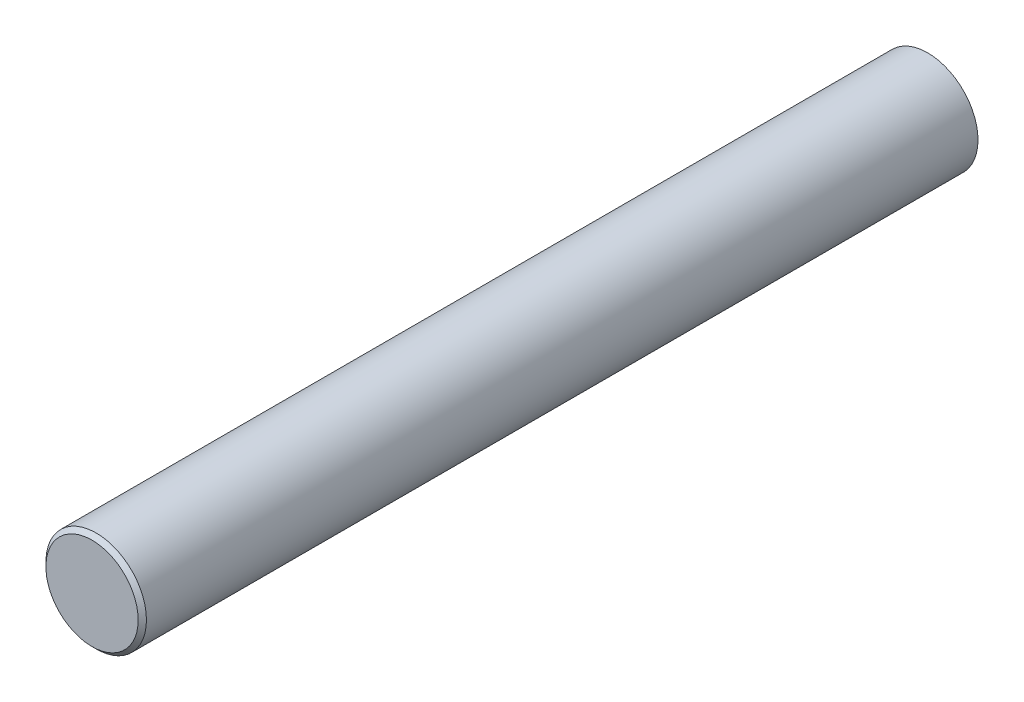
ISO-10303-21;
HEADER;
FILE_DESCRIPTION(('STEP AP214'),'2;1');
FILE_NAME('part.step','',(''),(''),'','','');
FILE_SCHEMA(('AUTOMOTIVE_DESIGN { 1 0 10303 214 1 1 1 1 }'));
ENDSEC;
DATA;
#1=APPLICATION_CONTEXT('core data for automotive mechanical design processes');
#2=APPLICATION_PROTOCOL_DEFINITION('international standard','automotive_design',2000,#1);
#3=PRODUCT_CONTEXT('',#1,'mechanical');
#4=PRODUCT('Part','Part','',(#3));
#5=PRODUCT_RELATED_PRODUCT_CATEGORY('part','',(#4));
#6=PRODUCT_DEFINITION_FORMATION('','',#4);
#7=PRODUCT_DEFINITION_CONTEXT('part definition',#1,'design');
#8=PRODUCT_DEFINITION('design','',#6,#7);
#9=PRODUCT_DEFINITION_SHAPE('','',#8);
#10=(LENGTH_UNIT() NAMED_UNIT(*) SI_UNIT(.MILLI.,.METRE.));
#11=(NAMED_UNIT(*) PLANE_ANGLE_UNIT() SI_UNIT($,.RADIAN.));
#12=(NAMED_UNIT(*) SI_UNIT($,.STERADIAN.) SOLID_ANGLE_UNIT());
#13=UNCERTAINTY_MEASURE_WITH_UNIT(LENGTH_MEASURE(1.E-05),#10,'distance_accuracy_value','');
#14=(GEOMETRIC_REPRESENTATION_CONTEXT(3) GLOBAL_UNCERTAINTY_ASSIGNED_CONTEXT((#13)) GLOBAL_UNIT_ASSIGNED_CONTEXT((#10,
#11,#12)) REPRESENTATION_CONTEXT('',''));
#15=CARTESIAN_POINT('',(0.,0.,0.));
#16=DIRECTION('',(0.,0.,1.));
#17=DIRECTION('',(1.,0.,0.));
#18=AXIS2_PLACEMENT_3D('',#15,#16,#17);
#19=CARTESIAN_POINT('',(62.,-2.08166817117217E-13,202.));
#20=DIRECTION('',(0.,0.,-1.));
#21=DIRECTION('',(-1.,0.,0.));
#22=AXIS2_PLACEMENT_3D('',#19,#20,#21);
#23=CYLINDRICAL_SURFACE('',#22,12.1500000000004);
#24=CARTESIAN_POINT('',(62.,-2.08166817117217E-13,201.));
#25=DIRECTION('',(0.,0.,1.));
#26=DIRECTION('',(1.,0.,0.));
#27=AXIS2_PLACEMENT_3D('',#24,#25,#26);
#28=CIRCLE('',#27,12.1500000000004);
#29=CARTESIAN_POINT('',(74.1500000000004,-2.08166817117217E-13,201.));
#30=VERTEX_POINT('',#29);
#31=EDGE_CURVE('E11',#30,#30,#28,.F.);
#32=ORIENTED_EDGE('',*,*,#31,.T.);
#33=EDGE_LOOP('',(#32));
#34=FACE_BOUND('',#33,.T.);
#35=CARTESIAN_POINT('',(62.,-2.08166817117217E-13,0.));
#36=DIRECTION('',(0.,0.,1.));
#37=DIRECTION('',(1.,0.,0.));
#38=AXIS2_PLACEMENT_3D('',#35,#36,#37);
#39=CIRCLE('',#38,12.1500000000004);
#40=CARTESIAN_POINT('',(74.1500000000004,-2.08166817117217E-13,0.));
#41=VERTEX_POINT('',#40);
#42=EDGE_CURVE('E35',#41,#41,#39,.T.);
#43=ORIENTED_EDGE('',*,*,#42,.T.);
#44=EDGE_LOOP('',(#43));
#45=FACE_BOUND('',#44,.T.);
#46=ADVANCED_FACE('F16',(#34,#45),#23,.T.);
#47=CARTESIAN_POINT('',(62.,-2.08166817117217E-13,202.));
#48=DIRECTION('',(0.,0.,1.));
#49=DIRECTION('',(1.,0.,0.));
#50=AXIS2_PLACEMENT_3D('',#47,#48,#49);
#51=PLANE('',#50);
#52=CARTESIAN_POINT('',(62.,-2.08166817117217E-13,202.));
#53=DIRECTION('',(0.,0.,1.));
#54=DIRECTION('',(1.,0.,0.));
#55=AXIS2_PLACEMENT_3D('',#52,#53,#54);
#56=CIRCLE('',#55,11.1500000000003);
#57=CARTESIAN_POINT('',(73.1500000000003,-2.08166817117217E-13,202.));
#58=VERTEX_POINT('',#57);
#59=EDGE_CURVE('E23',#58,#58,#56,.T.);
#60=ORIENTED_EDGE('',*,*,#59,.T.);
#61=EDGE_LOOP('',(#60));
#62=FACE_BOUND('',#61,.T.);
#63=ADVANCED_FACE('F45',(#62),#51,.T.);
#64=CARTESIAN_POINT('',(62.,-2.08166817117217E-13,0.));
#65=DIRECTION('',(0.,0.,1.));
#66=DIRECTION('',(1.,0.,0.));
#67=AXIS2_PLACEMENT_3D('',#64,#65,#66);
#68=PLANE('',#67);
#69=CARTESIAN_POINT('',(62.,-2.08166817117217E-13,0.));
#70=DIRECTION('',(0.,0.,-1.));
#71=DIRECTION('',(-1.,0.,0.));
#72=AXIS2_PLACEMENT_3D('',#69,#70,#71);
#73=CIRCLE('',#72,2.1);
#74=CARTESIAN_POINT('',(59.9,-2.08166817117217E-13,0.));
#75=VERTEX_POINT('',#74);
#76=EDGE_CURVE('E36',#75,#75,#73,.T.);
#77=ORIENTED_EDGE('',*,*,#76,.F.);
#78=EDGE_LOOP('',(#77));
#79=FACE_BOUND('',#78,.T.);
#80=ORIENTED_EDGE('',*,*,#42,.F.);
#81=EDGE_LOOP('',(#80));
#82=FACE_BOUND('',#81,.T.);
#83=ADVANCED_FACE('F48',(#79,#82),#68,.F.);
#84=CARTESIAN_POINT('',(62.,-2.08166817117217E-13,202.));
#85=DIRECTION('',(0.,0.,-1.));
#86=DIRECTION('',(-1.,0.,0.));
#87=AXIS2_PLACEMENT_3D('',#84,#85,#86);
#88=CONICAL_SURFACE('',#87,11.1500000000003,0.785398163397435);
#89=ORIENTED_EDGE('',*,*,#31,.F.);
#90=EDGE_LOOP('',(#89));
#91=FACE_BOUND('',#90,.T.);
#92=ORIENTED_EDGE('',*,*,#59,.F.);
#93=EDGE_LOOP('',(#92));
#94=FACE_BOUND('',#93,.T.);
#95=ADVANCED_FACE('F18',(#91,#94),#88,.T.);
#96=CARTESIAN_POINT('',(62.,-2.08166817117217E-13,18.4));
#97=DIRECTION('',(0.,0.,-1.));
#98=DIRECTION('',(-1.,0.,0.));
#99=AXIS2_PLACEMENT_3D('',#96,#97,#98);
#100=CONICAL_SURFACE('',#99,2.1,1.02974425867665);
#101=CARTESIAN_POINT('',(62.,-2.08166817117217E-13,19.6618072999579));
#102=VERTEX_POINT('',#101);
#103=VERTEX_LOOP('',#102);
#104=FACE_BOUND('',#103,.T.);
#105=CARTESIAN_POINT('',(62.,-2.08166817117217E-13,18.4));
#106=DIRECTION('',(0.,0.,-1.));
#107=DIRECTION('',(-1.,0.,0.));
#108=AXIS2_PLACEMENT_3D('',#105,#106,#107);
#109=CIRCLE('',#108,2.1);
#110=CARTESIAN_POINT('',(59.9,-2.08166817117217E-13,18.4));
#111=VERTEX_POINT('',#110);
#112=EDGE_CURVE('E33',#111,#111,#109,.T.);
#113=ORIENTED_EDGE('',*,*,#112,.T.);
#114=EDGE_LOOP('',(#113));
#115=FACE_BOUND('',#114,.T.);
#116=ADVANCED_FACE('F26',(#104,#115),#100,.F.);
#117=CARTESIAN_POINT('',(62.,-2.08166817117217E-13,0.));
#118=DIRECTION('',(0.,0.,-1.));
#119=DIRECTION('',(-1.,0.,0.));
#120=AXIS2_PLACEMENT_3D('',#117,#118,#119);
#121=CYLINDRICAL_SURFACE('',#120,2.1);
#122=ORIENTED_EDGE('',*,*,#112,.F.);
#123=EDGE_LOOP('',(#122));
#124=FACE_BOUND('',#123,.T.);
#125=ORIENTED_EDGE('',*,*,#76,.T.);
#126=EDGE_LOOP('',(#125));
#127=FACE_BOUND('',#126,.T.);
#128=ADVANCED_FACE('F29',(#124,#127),#121,.F.);
#129=CLOSED_SHELL('',(#46,#63,#83,#95,#116,#128));
#130=MANIFOLD_SOLID_BREP('B1',#129);
#131=ADVANCED_BREP_SHAPE_REPRESENTATION('',(#18,#130),#14);
#132=SHAPE_DEFINITION_REPRESENTATION(#9,#131);
ENDSEC;
END-ISO-10303-21;
